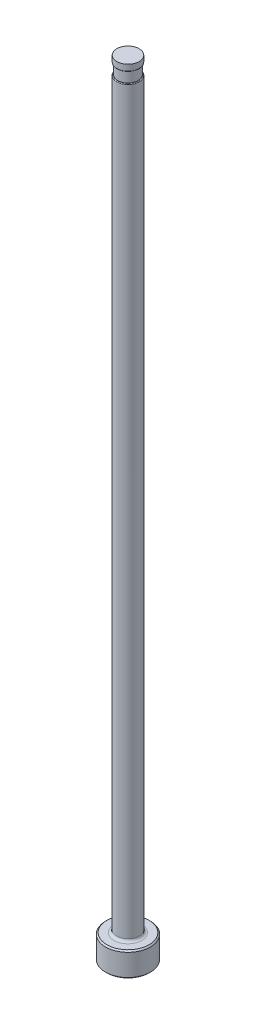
from build123d import *

# Parameters (mm, degrees)
CHAMFER1_SIZE     = 0.254
FILLET1_R         = 0.508
SKETCH2_W         = 0.2032
SKETCH2_H         = 2.032
D_SLOT_DEPTH      = 153.524461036
D_SLOT_DEPTH_BACK = 153.524461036
SKETCH5_W         = 0.0127
SKETCH5_H         = 1.27
FILLET2_R         = 0.127


with BuildPart() as part:
    # Sketch1 → Revolve1 (revolve)
    with BuildSketch(Plane.XY, mode=Mode.PRIVATE) as revolve1_sk:
        Polygon((0, 0), (-4.3561, 0), (-4.3561, 4.7498), (-2.18186, 4.7498), (-2.18186, 152.4), (0, 152.4), align=None)
    revolve(revolve1_sk.sketch.rotate(Axis((0, 259.958771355, 0), (0, -1, 0)), 270), axis=Axis((0, 259.958771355, 0), (0, -1, 0)))

    # Chamfer1
    chamfer1_edges = [part.edges().sort_by_distance(p)[0] for p in [
        (0, 4.7498, -4.3561),
        (0, 0, -4.3561),
    ]]
    chamfer(chamfer1_edges, length=CHAMFER1_SIZE)

    # Fillet1
    fillet1_edges = [part.edges().sort_by_distance(p)[0] for p in [
        (0, 4.7498, -2.18186),
    ]]
    fillet(fillet1_edges, radius=FILLET1_R)

    # Sketch2 → Vent Relief (revolve, cut)
    with BuildSketch(Plane.XY, mode=Mode.PRIVATE) as vent_relief_sk:
        with Locations((-2.08026, 150.114)):
            Rectangle(SKETCH2_W, SKETCH2_H)
    revolve(vent_relief_sk.sketch.rotate(Axis((0, 153.448281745, 0), (0, -1, 0)), 270), axis=Axis((0, 153.448281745, 0), (0, -1, 0)), mode=Mode.SUBTRACT)

    # Sketch3 → D-Slot (cut, two sides: drawn at the far end of the back side and taken through both)
    with BuildSketch(Plane.XY.offset(-D_SLOT_DEPTH_BACK)):
        with BuildLine():
            Line((-1.97866, 150.114), (-1.97866, 86.614))
            ThreePointArc((-1.97866, 86.614), (-2.029873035, 86.046038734), (-2.18186, 85.4964))
            Line((-2.18186, 85.4964), (-2.18186, 150.114))
            Line((-2.18186, 150.114), (-1.97866, 150.114))
        make_face()
    extrude(amount=D_SLOT_DEPTH + D_SLOT_DEPTH_BACK, mode=Mode.SUBTRACT)

    # Sketch5 → Vent Diameter (revolve, cut)
    with BuildSketch(Plane.XY, mode=Mode.PRIVATE) as vent_diameter_sk:
        with Locations((-2.17551, 151.765)):
            Rectangle(SKETCH5_W, SKETCH5_H)
    revolve(vent_diameter_sk.sketch.rotate(Axis((0, 152.687735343, 0), (0, -1, 0)), 90), axis=Axis((0, 152.687735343, 0), (0, -1, 0)), mode=Mode.SUBTRACT)

    # Fillet2
    fillet2_edges = [part.edges().sort_by_distance(p)[0] for p in [
        (1.839382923, 149.098, -1.173534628),
        (0, 151.13, 2.16916),
    ]]
    fillet(fillet2_edges, radius=FILLET2_R)


solid = part.part
